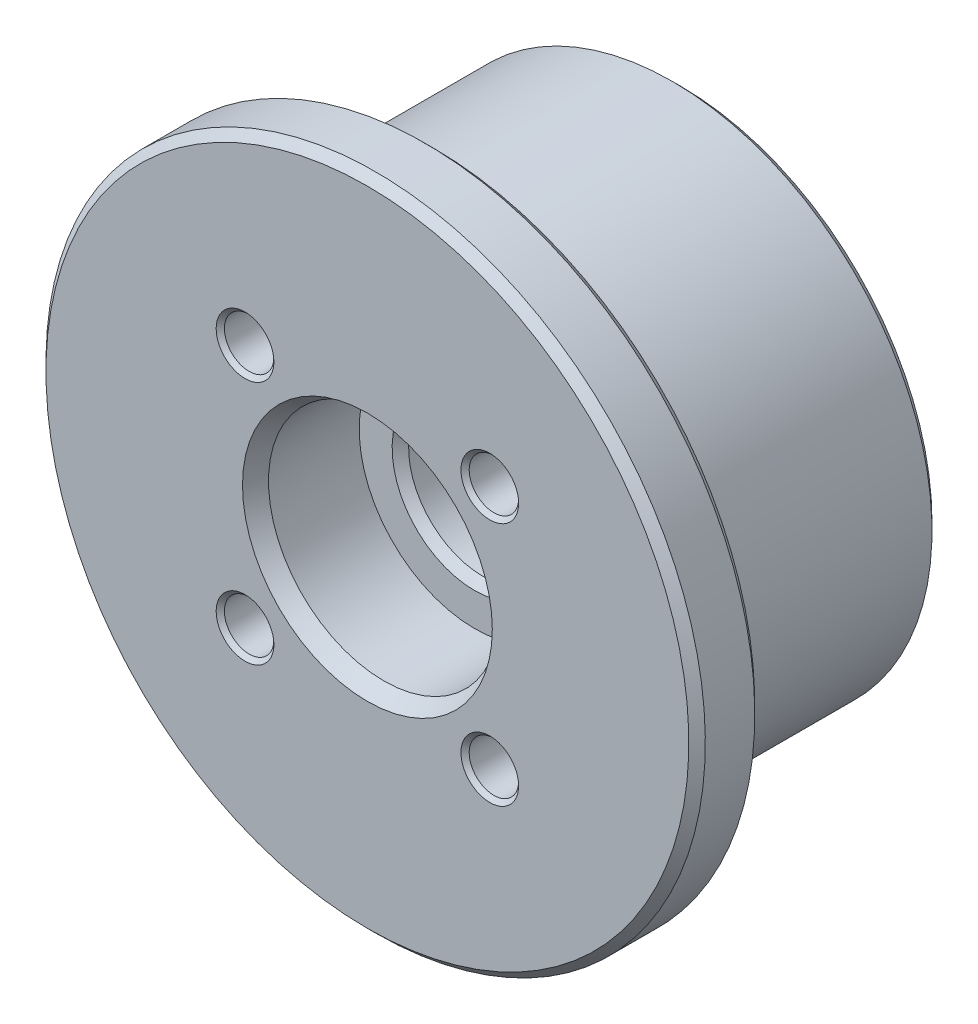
ISO-10303-21;
HEADER;
FILE_DESCRIPTION(('STEP AP214'),'2;1');
FILE_NAME('part.step','',(''),(''),'','','');
FILE_SCHEMA(('AUTOMOTIVE_DESIGN { 1 0 10303 214 1 1 1 1 }'));
ENDSEC;
DATA;
#1=APPLICATION_CONTEXT('core data for automotive mechanical design processes');
#2=APPLICATION_PROTOCOL_DEFINITION('international standard','automotive_design',2000,#1);
#3=PRODUCT_CONTEXT('',#1,'mechanical');
#4=PRODUCT('Part','Part','',(#3));
#5=PRODUCT_RELATED_PRODUCT_CATEGORY('part','',(#4));
#6=PRODUCT_DEFINITION_FORMATION('','',#4);
#7=PRODUCT_DEFINITION_CONTEXT('part definition',#1,'design');
#8=PRODUCT_DEFINITION('design','',#6,#7);
#9=PRODUCT_DEFINITION_SHAPE('','',#8);
#10=(LENGTH_UNIT() NAMED_UNIT(*) SI_UNIT(.MILLI.,.METRE.));
#11=(NAMED_UNIT(*) PLANE_ANGLE_UNIT() SI_UNIT($,.RADIAN.));
#12=(NAMED_UNIT(*) SI_UNIT($,.STERADIAN.) SOLID_ANGLE_UNIT());
#13=UNCERTAINTY_MEASURE_WITH_UNIT(LENGTH_MEASURE(1.E-05),#10,'distance_accuracy_value','');
#14=(GEOMETRIC_REPRESENTATION_CONTEXT(3) GLOBAL_UNCERTAINTY_ASSIGNED_CONTEXT((#13)) GLOBAL_UNIT_ASSIGNED_CONTEXT((#10,
#11,#12)) REPRESENTATION_CONTEXT('',''));
#15=CARTESIAN_POINT('',(0.,0.,0.));
#16=DIRECTION('',(0.,0.,1.));
#17=DIRECTION('',(1.,0.,0.));
#18=AXIS2_PLACEMENT_3D('',#15,#16,#17);
#19=CARTESIAN_POINT('',(40.,0.,30.));
#20=DIRECTION('',(0.,0.,1.));
#21=DIRECTION('',(0.,-1.,0.));
#22=AXIS2_PLACEMENT_3D('',#19,#20,#21);
#23=PLANE('',#22);
#24=CARTESIAN_POINT('',(0.,0.,30.));
#25=DIRECTION('',(0.,0.,1.));
#26=DIRECTION('',(0.,-1.,0.));
#27=AXIS2_PLACEMENT_3D('',#24,#25,#26);
#28=CIRCLE('',#27,39.);
#29=CARTESIAN_POINT('',(0.,-39.,30.));
#30=VERTEX_POINT('',#29);
#31=EDGE_CURVE('E99',#30,#30,#28,.F.);
#32=ORIENTED_EDGE('',*,*,#31,.T.);
#33=EDGE_LOOP('',(#32));
#34=FACE_BOUND('',#33,.T.);
#35=CARTESIAN_POINT('',(0.,0.,30.));
#36=DIRECTION('',(0.,0.,-1.));
#37=DIRECTION('',(0.,1.,0.));
#38=AXIS2_PLACEMENT_3D('',#35,#36,#37);
#39=CIRCLE('',#38,33.5);
#40=CARTESIAN_POINT('',(0.,33.5,30.));
#41=VERTEX_POINT('',#40);
#42=EDGE_CURVE('E63',#41,#41,#39,.T.);
#43=ORIENTED_EDGE('',*,*,#42,.F.);
#44=EDGE_LOOP('',(#43));
#45=FACE_BOUND('',#44,.T.);
#46=ADVANCED_FACE('F12',(#34,#45),#23,.F.);
#47=CARTESIAN_POINT('',(0.,0.,0.));
#48=DIRECTION('',(0.,0.,-1.));
#49=DIRECTION('',(0.,1.,0.));
#50=AXIS2_PLACEMENT_3D('',#47,#48,#49);
#51=CYLINDRICAL_SURFACE('',#50,31.5);
#52=CARTESIAN_POINT('',(0.,0.,1.00000000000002));
#53=DIRECTION('',(0.,0.,1.));
#54=DIRECTION('',(0.,-1.,0.));
#55=AXIS2_PLACEMENT_3D('',#52,#53,#54);
#56=CIRCLE('',#55,31.5);
#57=CARTESIAN_POINT('',(0.,-31.5,1.00000000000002));
#58=VERTEX_POINT('',#57);
#59=EDGE_CURVE('E96',#58,#58,#56,.T.);
#60=ORIENTED_EDGE('',*,*,#59,.T.);
#61=EDGE_LOOP('',(#60));
#62=FACE_BOUND('',#61,.T.);
#63=CARTESIAN_POINT('',(0.,0.,27.));
#64=DIRECTION('',(0.,0.,-1.));
#65=DIRECTION('',(0.,1.,0.));
#66=AXIS2_PLACEMENT_3D('',#63,#64,#65);
#67=CIRCLE('',#66,31.5);
#68=CARTESIAN_POINT('',(0.,31.5,27.));
#69=VERTEX_POINT('',#68);
#70=EDGE_CURVE('E32',#69,#69,#67,.T.);
#71=ORIENTED_EDGE('',*,*,#70,.T.);
#72=EDGE_LOOP('',(#71));
#73=FACE_BOUND('',#72,.T.);
#74=ADVANCED_FACE('F146',(#62,#73),#51,.T.);
#75=CARTESIAN_POINT('',(0.,0.,38.));
#76=DIRECTION('',(0.,0.,-1.));
#77=DIRECTION('',(0.,1.,0.));
#78=AXIS2_PLACEMENT_3D('',#75,#76,#77);
#79=CYLINDRICAL_SURFACE('',#78,40.);
#80=CARTESIAN_POINT('',(0.,0.,31.));
#81=DIRECTION('',(0.,0.,1.));
#82=DIRECTION('',(0.,-1.,0.));
#83=AXIS2_PLACEMENT_3D('',#80,#81,#82);
#84=CIRCLE('',#83,40.);
#85=CARTESIAN_POINT('',(0.,-40.,31.));
#86=VERTEX_POINT('',#85);
#87=EDGE_CURVE('E102',#86,#86,#84,.T.);
#88=ORIENTED_EDGE('',*,*,#87,.T.);
#89=EDGE_LOOP('',(#88));
#90=FACE_BOUND('',#89,.T.);
#91=CARTESIAN_POINT('',(0.,0.,37.));
#92=DIRECTION('',(0.,0.,1.));
#93=DIRECTION('',(0.,-1.,0.));
#94=AXIS2_PLACEMENT_3D('',#91,#92,#93);
#95=CIRCLE('',#94,40.);
#96=CARTESIAN_POINT('',(0.,-40.,37.));
#97=VERTEX_POINT('',#96);
#98=EDGE_CURVE('E81',#97,#97,#95,.F.);
#99=ORIENTED_EDGE('',*,*,#98,.T.);
#100=EDGE_LOOP('',(#99));
#101=FACE_BOUND('',#100,.T.);
#102=ADVANCED_FACE('F153',(#90,#101),#79,.T.);
#103=CARTESIAN_POINT('',(0.,0.,38.));
#104=DIRECTION('',(0.,0.,1.));
#105=DIRECTION('',(0.,-1.,0.));
#106=AXIS2_PLACEMENT_3D('',#103,#104,#105);
#107=PLANE('',#106);
#108=CARTESIAN_POINT('',(0.,0.,38.));
#109=DIRECTION('',(0.,0.,1.));
#110=DIRECTION('',(0.,-1.,0.));
#111=AXIS2_PLACEMENT_3D('',#108,#109,#110);
#112=CIRCLE('',#111,15.1547005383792);
#113=CARTESIAN_POINT('',(0.,-15.1547005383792,38.));
#114=VERTEX_POINT('',#113);
#115=EDGE_CURVE('E90',#114,#114,#112,.F.);
#116=ORIENTED_EDGE('',*,*,#115,.T.);
#117=EDGE_LOOP('',(#116));
#118=FACE_BOUND('',#117,.T.);
#119=CARTESIAN_POINT('',(0.,0.,38.));
#120=DIRECTION('',(0.,0.,1.));
#121=DIRECTION('',(0.,-1.,0.));
#122=AXIS2_PLACEMENT_3D('',#119,#120,#121);
#123=CIRCLE('',#122,39.);
#124=CARTESIAN_POINT('',(0.,-39.,38.));
#125=VERTEX_POINT('',#124);
#126=EDGE_CURVE('E84',#125,#125,#123,.T.);
#127=ORIENTED_EDGE('',*,*,#126,.T.);
#128=EDGE_LOOP('',(#127));
#129=FACE_BOUND('',#128,.T.);
#130=CARTESIAN_POINT('',(-14.8492424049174,14.8492424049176,38.));
#131=DIRECTION('',(0.,0.,1.));
#132=DIRECTION('',(0.,-1.,0.));
#133=AXIS2_PLACEMENT_3D('',#130,#131,#132);
#134=CIRCLE('',#133,3.5);
#135=CARTESIAN_POINT('',(-14.8492424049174,11.3492424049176,38.));
#136=VERTEX_POINT('',#135);
#137=EDGE_CURVE('E66',#136,#136,#134,.T.);
#138=ORIENTED_EDGE('',*,*,#137,.F.);
#139=EDGE_LOOP('',(#138));
#140=FACE_BOUND('',#139,.T.);
#141=CARTESIAN_POINT('',(-14.8492424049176,-14.8492424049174,38.));
#142=DIRECTION('',(0.,0.,1.));
#143=DIRECTION('',(0.,-1.,0.));
#144=AXIS2_PLACEMENT_3D('',#141,#142,#143);
#145=CIRCLE('',#144,3.5);
#146=CARTESIAN_POINT('',(-14.8492424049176,-18.3492424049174,38.));
#147=VERTEX_POINT('',#146);
#148=EDGE_CURVE('E69',#147,#147,#145,.T.);
#149=ORIENTED_EDGE('',*,*,#148,.F.);
#150=EDGE_LOOP('',(#149));
#151=FACE_BOUND('',#150,.T.);
#152=CARTESIAN_POINT('',(14.8492424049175,-14.8492424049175,38.));
#153=DIRECTION('',(0.,0.,1.));
#154=DIRECTION('',(0.,-1.,0.));
#155=AXIS2_PLACEMENT_3D('',#152,#153,#154);
#156=CIRCLE('',#155,3.5);
#157=CARTESIAN_POINT('',(14.8492424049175,-18.3492424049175,38.));
#158=VERTEX_POINT('',#157);
#159=EDGE_CURVE('E72',#158,#158,#156,.T.);
#160=ORIENTED_EDGE('',*,*,#159,.F.);
#161=EDGE_LOOP('',(#160));
#162=FACE_BOUND('',#161,.T.);
#163=CARTESIAN_POINT('',(14.8492424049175,14.8492424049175,38.));
#164=DIRECTION('',(0.,0.,1.));
#165=DIRECTION('',(0.,-1.,0.));
#166=AXIS2_PLACEMENT_3D('',#163,#164,#165);
#167=CIRCLE('',#166,3.5);
#168=CARTESIAN_POINT('',(14.8492424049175,11.3492424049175,38.));
#169=VERTEX_POINT('',#168);
#170=EDGE_CURVE('E75',#169,#169,#167,.T.);
#171=ORIENTED_EDGE('',*,*,#170,.F.);
#172=EDGE_LOOP('',(#171));
#173=FACE_BOUND('',#172,.T.);
#174=ADVANCED_FACE('F122',(#118,#129,#140,#151,#162,#173),#107,.T.);
#175=CARTESIAN_POINT('',(0.,0.,0.));
#176=DIRECTION('',(0.,0.,1.));
#177=DIRECTION('',(0.,-1.,0.));
#178=AXIS2_PLACEMENT_3D('',#175,#176,#177);
#179=PLANE('',#178);
#180=CARTESIAN_POINT('',(0.,0.,0.));
#181=DIRECTION('',(0.,0.,1.));
#182=DIRECTION('',(0.,-1.,0.));
#183=AXIS2_PLACEMENT_3D('',#180,#181,#182);
#184=CIRCLE('',#183,10.1547005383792);
#185=CARTESIAN_POINT('',(0.,-10.1547005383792,0.));
#186=VERTEX_POINT('',#185);
#187=EDGE_CURVE('E105',#186,#186,#184,.T.);
#188=ORIENTED_EDGE('',*,*,#187,.T.);
#189=EDGE_LOOP('',(#188));
#190=FACE_BOUND('',#189,.T.);
#191=CARTESIAN_POINT('',(0.,0.,0.));
#192=DIRECTION('',(0.,0.,1.));
#193=DIRECTION('',(0.,-1.,0.));
#194=AXIS2_PLACEMENT_3D('',#191,#192,#193);
#195=CIRCLE('',#194,30.5);
#196=CARTESIAN_POINT('',(0.,-30.5,0.));
#197=VERTEX_POINT('',#196);
#198=EDGE_CURVE('E93',#197,#197,#195,.F.);
#199=ORIENTED_EDGE('',*,*,#198,.T.);
#200=EDGE_LOOP('',(#199));
#201=FACE_BOUND('',#200,.T.);
#202=ADVANCED_FACE('F118',(#190,#201),#179,.F.);
#203=CARTESIAN_POINT('',(0.,0.,25.));
#204=DIRECTION('',(0.,0.,1.));
#205=DIRECTION('',(0.,-1.,0.));
#206=AXIS2_PLACEMENT_3D('',#203,#204,#205);
#207=CYLINDRICAL_SURFACE('',#206,14.);
#208=CARTESIAN_POINT('',(0.,0.,36.));
#209=DIRECTION('',(0.,0.,1.));
#210=DIRECTION('',(0.,-1.,0.));
#211=AXIS2_PLACEMENT_3D('',#208,#209,#210);
#212=CIRCLE('',#211,14.);
#213=CARTESIAN_POINT('',(0.,-14.,36.));
#214=VERTEX_POINT('',#213);
#215=EDGE_CURVE('E87',#214,#214,#212,.T.);
#216=ORIENTED_EDGE('',*,*,#215,.T.);
#217=EDGE_LOOP('',(#216));
#218=FACE_BOUND('',#217,.T.);
#219=CARTESIAN_POINT('',(0.,0.,25.));
#220=DIRECTION('',(0.,0.,1.));
#221=DIRECTION('',(0.,-1.,0.));
#222=AXIS2_PLACEMENT_3D('',#219,#220,#221);
#223=CIRCLE('',#222,14.);
#224=CARTESIAN_POINT('',(0.,-14.,25.));
#225=VERTEX_POINT('',#224);
#226=EDGE_CURVE('E78',#225,#225,#223,.T.);
#227=ORIENTED_EDGE('',*,*,#226,.F.);
#228=EDGE_LOOP('',(#227));
#229=FACE_BOUND('',#228,.T.);
#230=ADVANCED_FACE('F121',(#218,#229),#207,.F.);
#231=CARTESIAN_POINT('',(0.,0.,25.));
#232=DIRECTION('',(0.,0.,1.));
#233=DIRECTION('',(0.,-1.,0.));
#234=AXIS2_PLACEMENT_3D('',#231,#232,#233);
#235=PLANE('',#234);
#236=CARTESIAN_POINT('',(0.,0.,25.));
#237=DIRECTION('',(0.,0.,1.));
#238=DIRECTION('',(0.,-1.,0.));
#239=AXIS2_PLACEMENT_3D('',#236,#237,#238);
#240=CIRCLE('',#239,10.);
#241=CARTESIAN_POINT('',(0.,-10.,25.));
#242=VERTEX_POINT('',#241);
#243=EDGE_CURVE('E8',#242,#242,#240,.F.);
#244=ORIENTED_EDGE('',*,*,#243,.T.);
#245=EDGE_LOOP('',(#244));
#246=FACE_BOUND('',#245,.T.);
#247=ORIENTED_EDGE('',*,*,#226,.T.);
#248=EDGE_LOOP('',(#247));
#249=FACE_BOUND('',#248,.T.);
#250=ADVANCED_FACE('F176',(#246,#249),#235,.T.);
#251=CARTESIAN_POINT('',(0.,0.,38.));
#252=DIRECTION('',(0.,0.,1.));
#253=DIRECTION('',(0.,-1.,0.));
#254=AXIS2_PLACEMENT_3D('',#251,#252,#253);
#255=CYLINDRICAL_SURFACE('',#254,9.);
#256=CARTESIAN_POINT('',(0.,0.,24.));
#257=DIRECTION('',(0.,0.,1.));
#258=DIRECTION('',(0.,-1.,0.));
#259=AXIS2_PLACEMENT_3D('',#256,#257,#258);
#260=CIRCLE('',#259,9.);
#261=CARTESIAN_POINT('',(0.,-9.,24.));
#262=VERTEX_POINT('',#261);
#263=EDGE_CURVE('E20',#262,#262,#260,.T.);
#264=ORIENTED_EDGE('',*,*,#263,.T.);
#265=EDGE_LOOP('',(#264));
#266=FACE_BOUND('',#265,.T.);
#267=CARTESIAN_POINT('',(0.,0.,2.));
#268=DIRECTION('',(0.,0.,1.));
#269=DIRECTION('',(0.,-1.,0.));
#270=AXIS2_PLACEMENT_3D('',#267,#268,#269);
#271=CIRCLE('',#270,9.);
#272=CARTESIAN_POINT('',(0.,-9.,2.));
#273=VERTEX_POINT('',#272);
#274=EDGE_CURVE('E25',#273,#273,#271,.F.);
#275=ORIENTED_EDGE('',*,*,#274,.T.);
#276=EDGE_LOOP('',(#275));
#277=FACE_BOUND('',#276,.T.);
#278=ADVANCED_FACE('F110',(#266,#277),#255,.F.);
#279=CARTESIAN_POINT('',(14.8492424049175,14.8492424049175,38.));
#280=DIRECTION('',(0.,0.,1.));
#281=DIRECTION('',(0.,-1.,0.));
#282=AXIS2_PLACEMENT_3D('',#279,#280,#281);
#283=CONICAL_SURFACE('',#282,3.5,0.785398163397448);
#284=CARTESIAN_POINT('',(14.8492424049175,14.8492424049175,37.5));
#285=DIRECTION('',(0.,0.,1.));
#286=DIRECTION('',(1.,0.,0.));
#287=AXIS2_PLACEMENT_3D('',#284,#285,#286);
#288=CIRCLE('',#287,3.);
#289=CARTESIAN_POINT('',(17.8492424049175,14.8492424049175,37.5));
#290=VERTEX_POINT('',#289);
#291=EDGE_CURVE('E35',#290,#290,#288,.F.);
#292=ORIENTED_EDGE('',*,*,#291,.T.);
#293=EDGE_LOOP('',(#292));
#294=FACE_BOUND('',#293,.T.);
#295=ORIENTED_EDGE('',*,*,#170,.T.);
#296=EDGE_LOOP('',(#295));
#297=FACE_BOUND('',#296,.T.);
#298=ADVANCED_FACE('F170',(#294,#297),#283,.F.);
#299=CARTESIAN_POINT('',(14.8492424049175,-14.8492424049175,38.));
#300=DIRECTION('',(0.,0.,1.));
#301=DIRECTION('',(0.,-1.,0.));
#302=AXIS2_PLACEMENT_3D('',#299,#300,#301);
#303=CONICAL_SURFACE('',#302,3.5,0.78539816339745);
#304=CARTESIAN_POINT('',(14.8492424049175,-14.8492424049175,37.5));
#305=DIRECTION('',(0.,0.,1.));
#306=DIRECTION('',(1.,0.,0.));
#307=AXIS2_PLACEMENT_3D('',#304,#305,#306);
#308=CIRCLE('',#307,3.);
#309=CARTESIAN_POINT('',(17.8492424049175,-14.8492424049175,37.5));
#310=VERTEX_POINT('',#309);
#311=EDGE_CURVE('E16',#310,#310,#308,.F.);
#312=ORIENTED_EDGE('',*,*,#311,.T.);
#313=EDGE_LOOP('',(#312));
#314=FACE_BOUND('',#313,.T.);
#315=ORIENTED_EDGE('',*,*,#159,.T.);
#316=EDGE_LOOP('',(#315));
#317=FACE_BOUND('',#316,.T.);
#318=ADVANCED_FACE('F166',(#314,#317),#303,.F.);
#319=CARTESIAN_POINT('',(-14.8492424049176,-14.8492424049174,38.));
#320=DIRECTION('',(0.,0.,1.));
#321=DIRECTION('',(0.,-1.,0.));
#322=AXIS2_PLACEMENT_3D('',#319,#320,#321);
#323=CONICAL_SURFACE('',#322,3.5,0.785398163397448);
#324=CARTESIAN_POINT('',(-14.8492424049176,-14.8492424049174,37.5));
#325=DIRECTION('',(0.,0.,1.));
#326=DIRECTION('',(1.,0.,0.));
#327=AXIS2_PLACEMENT_3D('',#324,#325,#326);
#328=CIRCLE('',#327,3.);
#329=CARTESIAN_POINT('',(-11.8492424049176,-14.8492424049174,37.5));
#330=VERTEX_POINT('',#329);
#331=EDGE_CURVE('E29',#330,#330,#328,.F.);
#332=ORIENTED_EDGE('',*,*,#331,.T.);
#333=EDGE_LOOP('',(#332));
#334=FACE_BOUND('',#333,.T.);
#335=ORIENTED_EDGE('',*,*,#148,.T.);
#336=EDGE_LOOP('',(#335));
#337=FACE_BOUND('',#336,.T.);
#338=ADVANCED_FACE('F162',(#334,#337),#323,.F.);
#339=CARTESIAN_POINT('',(-14.8492424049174,14.8492424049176,38.));
#340=DIRECTION('',(0.,0.,1.));
#341=DIRECTION('',(0.,-1.,0.));
#342=AXIS2_PLACEMENT_3D('',#339,#340,#341);
#343=CONICAL_SURFACE('',#342,3.5,0.785398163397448);
#344=CARTESIAN_POINT('',(-14.8492424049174,14.8492424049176,37.5));
#345=DIRECTION('',(0.,0.,1.));
#346=DIRECTION('',(1.,0.,0.));
#347=AXIS2_PLACEMENT_3D('',#344,#345,#346);
#348=CIRCLE('',#347,3.);
#349=CARTESIAN_POINT('',(-11.8492424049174,14.8492424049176,37.5));
#350=VERTEX_POINT('',#349);
#351=EDGE_CURVE('E33',#350,#350,#348,.F.);
#352=ORIENTED_EDGE('',*,*,#351,.T.);
#353=EDGE_LOOP('',(#352));
#354=FACE_BOUND('',#353,.T.);
#355=ORIENTED_EDGE('',*,*,#137,.T.);
#356=EDGE_LOOP('',(#355));
#357=FACE_BOUND('',#356,.T.);
#358=ADVANCED_FACE('F159',(#354,#357),#343,.F.);
#359=CARTESIAN_POINT('',(0.,0.,38.));
#360=DIRECTION('',(0.,0.,-1.));
#361=DIRECTION('',(0.,1.,0.));
#362=AXIS2_PLACEMENT_3D('',#359,#360,#361);
#363=CONICAL_SURFACE('',#362,39.,0.785398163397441);
#364=ORIENTED_EDGE('',*,*,#98,.F.);
#365=EDGE_LOOP('',(#364));
#366=FACE_BOUND('',#365,.T.);
#367=ORIENTED_EDGE('',*,*,#126,.F.);
#368=EDGE_LOOP('',(#367));
#369=FACE_BOUND('',#368,.T.);
#370=ADVANCED_FACE('F141',(#366,#369),#363,.T.);
#371=CARTESIAN_POINT('',(0.,0.,36.));
#372=DIRECTION('',(0.,0.,1.));
#373=DIRECTION('',(0.,-1.,0.));
#374=AXIS2_PLACEMENT_3D('',#371,#372,#373);
#375=CONICAL_SURFACE('',#374,14.,0.523598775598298);
#376=ORIENTED_EDGE('',*,*,#115,.F.);
#377=EDGE_LOOP('',(#376));
#378=FACE_BOUND('',#377,.T.);
#379=ORIENTED_EDGE('',*,*,#215,.F.);
#380=EDGE_LOOP('',(#379));
#381=FACE_BOUND('',#380,.T.);
#382=ADVANCED_FACE('F129',(#378,#381),#375,.F.);
#383=CARTESIAN_POINT('',(0.,0.,0.));
#384=DIRECTION('',(0.,0.,1.));
#385=DIRECTION('',(0.,-1.,0.));
#386=AXIS2_PLACEMENT_3D('',#383,#384,#385);
#387=CONICAL_SURFACE('',#386,30.5,0.785398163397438);
#388=ORIENTED_EDGE('',*,*,#59,.F.);
#389=EDGE_LOOP('',(#388));
#390=FACE_BOUND('',#389,.T.);
#391=ORIENTED_EDGE('',*,*,#198,.F.);
#392=EDGE_LOOP('',(#391));
#393=FACE_BOUND('',#392,.T.);
#394=ADVANCED_FACE('F126',(#390,#393),#387,.T.);
#395=CARTESIAN_POINT('',(0.,0.,30.));
#396=DIRECTION('',(0.,0.,1.));
#397=DIRECTION('',(0.,-1.,0.));
#398=AXIS2_PLACEMENT_3D('',#395,#396,#397);
#399=CONICAL_SURFACE('',#398,39.,0.785398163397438);
#400=ORIENTED_EDGE('',*,*,#87,.F.);
#401=EDGE_LOOP('',(#400));
#402=FACE_BOUND('',#401,.T.);
#403=ORIENTED_EDGE('',*,*,#31,.F.);
#404=EDGE_LOOP('',(#403));
#405=FACE_BOUND('',#404,.T.);
#406=ADVANCED_FACE('F128',(#402,#405),#399,.T.);
#407=CARTESIAN_POINT('',(0.,0.,30.5));
#408=DIRECTION('',(0.,0.,-1.));
#409=DIRECTION('',(0.,1.,0.));
#410=AXIS2_PLACEMENT_3D('',#407,#408,#409);
#411=CONICAL_SURFACE('',#410,33.,0.785398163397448);
#412=ORIENTED_EDGE('',*,*,#42,.T.);
#413=EDGE_LOOP('',(#412));
#414=FACE_BOUND('',#413,.T.);
#415=CARTESIAN_POINT('',(0.,0.,30.5));
#416=DIRECTION('',(0.,0.,-1.));
#417=DIRECTION('',(0.,1.,0.));
#418=AXIS2_PLACEMENT_3D('',#415,#416,#417);
#419=CIRCLE('',#418,33.);
#420=CARTESIAN_POINT('',(0.,33.,30.5));
#421=VERTEX_POINT('',#420);
#422=EDGE_CURVE('E60',#421,#421,#419,.T.);
#423=ORIENTED_EDGE('',*,*,#422,.F.);
#424=EDGE_LOOP('',(#423));
#425=FACE_BOUND('',#424,.T.);
#426=ADVANCED_FACE('F138',(#414,#425),#411,.F.);
#427=CARTESIAN_POINT('',(-33.,0.,30.5));
#428=DIRECTION('',(0.,0.,-1.));
#429=DIRECTION('',(0.,1.,0.));
#430=AXIS2_PLACEMENT_3D('',#427,#428,#429);
#431=PLANE('',#430);
#432=ORIENTED_EDGE('',*,*,#422,.T.);
#433=EDGE_LOOP('',(#432));
#434=FACE_BOUND('',#433,.T.);
#435=CARTESIAN_POINT('',(0.,0.,30.5));
#436=DIRECTION('',(0.,0.,-1.));
#437=DIRECTION('',(0.,1.,0.));
#438=AXIS2_PLACEMENT_3D('',#435,#436,#437);
#439=CIRCLE('',#438,31.4);
#440=CARTESIAN_POINT('',(0.,31.4,30.5));
#441=VERTEX_POINT('',#440);
#442=EDGE_CURVE('E57',#441,#441,#439,.T.);
#443=ORIENTED_EDGE('',*,*,#442,.F.);
#444=EDGE_LOOP('',(#443));
#445=FACE_BOUND('',#444,.T.);
#446=ADVANCED_FACE('F310',(#434,#445),#431,.T.);
#447=CARTESIAN_POINT('',(0.,0.,30.1));
#448=DIRECTION('',(0.,0.,-1.));
#449=DIRECTION('',(0.,1.,0.));
#450=AXIS2_PLACEMENT_3D('',#447,#448,#449);
#451=TOROIDAL_SURFACE('',#450,31.4,0.4);
#452=ORIENTED_EDGE('',*,*,#442,.T.);
#453=EDGE_LOOP('',(#452));
#454=FACE_BOUND('',#453,.T.);
#455=CARTESIAN_POINT('',(0.,0.,30.1));
#456=DIRECTION('',(0.,0.,-1.));
#457=DIRECTION('',(0.,1.,0.));
#458=AXIS2_PLACEMENT_3D('',#455,#456,#457);
#459=CIRCLE('',#458,31.);
#460=CARTESIAN_POINT('',(0.,31.,30.1));
#461=VERTEX_POINT('',#460);
#462=EDGE_CURVE('E54',#461,#461,#459,.T.);
#463=ORIENTED_EDGE('',*,*,#462,.F.);
#464=EDGE_LOOP('',(#463));
#465=FACE_BOUND('',#464,.T.);
#466=ADVANCED_FACE('F317',(#454,#465),#451,.F.);
#467=CARTESIAN_POINT('',(0.,0.,0.));
#468=DIRECTION('',(0.,0.,-1.));
#469=DIRECTION('',(0.,1.,0.));
#470=AXIS2_PLACEMENT_3D('',#467,#468,#469);
#471=CYLINDRICAL_SURFACE('',#470,31.);
#472=ORIENTED_EDGE('',*,*,#462,.T.);
#473=EDGE_LOOP('',(#472));
#474=FACE_BOUND('',#473,.T.);
#475=CARTESIAN_POINT('',(0.,0.,27.5));
#476=DIRECTION('',(0.,0.,-1.));
#477=DIRECTION('',(0.,1.,0.));
#478=AXIS2_PLACEMENT_3D('',#475,#476,#477);
#479=CIRCLE('',#478,31.);
#480=CARTESIAN_POINT('',(0.,31.,27.5));
#481=VERTEX_POINT('',#480);
#482=EDGE_CURVE('E51',#481,#481,#479,.T.);
#483=ORIENTED_EDGE('',*,*,#482,.F.);
#484=EDGE_LOOP('',(#483));
#485=FACE_BOUND('',#484,.T.);
#486=ADVANCED_FACE('F325',(#474,#485),#471,.T.);
#487=CARTESIAN_POINT('',(0.,0.,27.));
#488=DIRECTION('',(0.,0.,-1.));
#489=DIRECTION('',(0.,1.,0.));
#490=AXIS2_PLACEMENT_3D('',#487,#488,#489);
#491=CONICAL_SURFACE('',#490,31.5,0.785398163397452);
#492=ORIENTED_EDGE('',*,*,#482,.T.);
#493=EDGE_LOOP('',(#492));
#494=FACE_BOUND('',#493,.T.);
#495=ORIENTED_EDGE('',*,*,#70,.F.);
#496=EDGE_LOOP('',(#495));
#497=FACE_BOUND('',#496,.T.);
#498=ADVANCED_FACE('F115',(#494,#497),#491,.T.);
#499=CARTESIAN_POINT('',(0.,0.,0.));
#500=DIRECTION('',(0.,0.,-1.));
#501=DIRECTION('',(0.,1.,0.));
#502=AXIS2_PLACEMENT_3D('',#499,#500,#501);
#503=CONICAL_SURFACE('',#502,10.1547005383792,0.523598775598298);
#504=ORIENTED_EDGE('',*,*,#274,.F.);
#505=EDGE_LOOP('',(#504));
#506=FACE_BOUND('',#505,.T.);
#507=ORIENTED_EDGE('',*,*,#187,.F.);
#508=EDGE_LOOP('',(#507));
#509=FACE_BOUND('',#508,.T.);
#510=ADVANCED_FACE('F112',(#506,#509),#503,.F.);
#511=CARTESIAN_POINT('',(0.,0.,24.));
#512=DIRECTION('',(0.,0.,1.));
#513=DIRECTION('',(0.,-1.,0.));
#514=AXIS2_PLACEMENT_3D('',#511,#512,#513);
#515=CONICAL_SURFACE('',#514,9.,0.785398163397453);
#516=ORIENTED_EDGE('',*,*,#243,.F.);
#517=EDGE_LOOP('',(#516));
#518=FACE_BOUND('',#517,.T.);
#519=ORIENTED_EDGE('',*,*,#263,.F.);
#520=EDGE_LOOP('',(#519));
#521=FACE_BOUND('',#520,.T.);
#522=ADVANCED_FACE('F14',(#518,#521),#515,.F.);
#523=CARTESIAN_POINT('',(-14.8492424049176,-14.8492424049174,26.));
#524=DIRECTION('',(0.,0.,1.));
#525=DIRECTION('',(1.,0.,0.));
#526=AXIS2_PLACEMENT_3D('',#523,#524,#525);
#527=CYLINDRICAL_SURFACE('',#526,3.);
#528=CARTESIAN_POINT('',(-14.8492424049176,-14.8492424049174,26.));
#529=DIRECTION('',(0.,0.,1.));
#530=DIRECTION('',(1.,0.,0.));
#531=AXIS2_PLACEMENT_3D('',#528,#529,#530);
#532=CIRCLE('',#531,3.);
#533=CARTESIAN_POINT('',(-11.8492424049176,-14.8492424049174,26.));
#534=VERTEX_POINT('',#533);
#535=EDGE_CURVE('E447',#534,#534,#532,.T.);
#536=ORIENTED_EDGE('',*,*,#535,.F.);
#537=EDGE_LOOP('',(#536));
#538=FACE_BOUND('',#537,.T.);
#539=ORIENTED_EDGE('',*,*,#331,.F.);
#540=EDGE_LOOP('',(#539));
#541=FACE_BOUND('',#540,.T.);
#542=ADVANCED_FACE('F348',(#538,#541),#527,.F.);
#543=CARTESIAN_POINT('',(-14.8492424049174,14.8492424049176,26.));
#544=DIRECTION('',(0.,0.,1.));
#545=DIRECTION('',(1.,0.,0.));
#546=AXIS2_PLACEMENT_3D('',#543,#544,#545);
#547=CYLINDRICAL_SURFACE('',#546,3.);
#548=CARTESIAN_POINT('',(-14.8492424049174,14.8492424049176,26.));
#549=DIRECTION('',(0.,0.,1.));
#550=DIRECTION('',(1.,0.,0.));
#551=AXIS2_PLACEMENT_3D('',#548,#549,#550);
#552=CIRCLE('',#551,3.);
#553=CARTESIAN_POINT('',(-11.8492424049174,14.8492424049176,26.));
#554=VERTEX_POINT('',#553);
#555=EDGE_CURVE('E446',#554,#554,#552,.T.);
#556=ORIENTED_EDGE('',*,*,#555,.F.);
#557=EDGE_LOOP('',(#556));
#558=FACE_BOUND('',#557,.T.);
#559=ORIENTED_EDGE('',*,*,#351,.F.);
#560=EDGE_LOOP('',(#559));
#561=FACE_BOUND('',#560,.T.);
#562=ADVANCED_FACE('F355',(#558,#561),#547,.F.);
#563=CARTESIAN_POINT('',(14.8492424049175,14.8492424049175,26.));
#564=DIRECTION('',(0.,0.,1.));
#565=DIRECTION('',(1.,0.,0.));
#566=AXIS2_PLACEMENT_3D('',#563,#564,#565);
#567=PLANE('',#566);
#568=CARTESIAN_POINT('',(14.8492424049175,14.8492424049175,26.));
#569=DIRECTION('',(0.,0.,1.));
#570=DIRECTION('',(1.,0.,0.));
#571=AXIS2_PLACEMENT_3D('',#568,#569,#570);
#572=CIRCLE('',#571,3.);
#573=CARTESIAN_POINT('',(17.8492424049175,14.8492424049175,26.));
#574=VERTEX_POINT('',#573);
#575=EDGE_CURVE('E37',#574,#574,#572,.T.);
#576=ORIENTED_EDGE('',*,*,#575,.T.);
#577=EDGE_LOOP('',(#576));
#578=FACE_BOUND('',#577,.T.);
#579=ADVANCED_FACE('F363',(#578),#567,.T.);
#580=CARTESIAN_POINT('',(14.8492424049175,14.8492424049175,26.));
#581=DIRECTION('',(0.,0.,1.));
#582=DIRECTION('',(1.,0.,0.));
#583=AXIS2_PLACEMENT_3D('',#580,#581,#582);
#584=CYLINDRICAL_SURFACE('',#583,3.);
#585=ORIENTED_EDGE('',*,*,#575,.F.);
#586=EDGE_LOOP('',(#585));
#587=FACE_BOUND('',#586,.T.);
#588=ORIENTED_EDGE('',*,*,#291,.F.);
#589=EDGE_LOOP('',(#588));
#590=FACE_BOUND('',#589,.T.);
#591=ADVANCED_FACE('F371',(#587,#590),#584,.F.);
#592=CARTESIAN_POINT('',(14.8492424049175,-14.8492424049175,26.));
#593=DIRECTION('',(0.,0.,1.));
#594=DIRECTION('',(1.,0.,0.));
#595=AXIS2_PLACEMENT_3D('',#592,#593,#594);
#596=PLANE('',#595);
#597=CARTESIAN_POINT('',(14.8492424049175,-14.8492424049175,26.));
#598=DIRECTION('',(0.,0.,1.));
#599=DIRECTION('',(1.,0.,0.));
#600=AXIS2_PLACEMENT_3D('',#597,#598,#599);
#601=CIRCLE('',#600,3.);
#602=CARTESIAN_POINT('',(17.8492424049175,-14.8492424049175,26.));
#603=VERTEX_POINT('',#602);
#604=EDGE_CURVE('E45',#603,#603,#601,.T.);
#605=ORIENTED_EDGE('',*,*,#604,.T.);
#606=EDGE_LOOP('',(#605));
#607=FACE_BOUND('',#606,.T.);
#608=ADVANCED_FACE('F378',(#607),#596,.T.);
#609=CARTESIAN_POINT('',(14.8492424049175,-14.8492424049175,26.));
#610=DIRECTION('',(0.,0.,1.));
#611=DIRECTION('',(1.,0.,0.));
#612=AXIS2_PLACEMENT_3D('',#609,#610,#611);
#613=CYLINDRICAL_SURFACE('',#612,3.);
#614=ORIENTED_EDGE('',*,*,#604,.F.);
#615=EDGE_LOOP('',(#614));
#616=FACE_BOUND('',#615,.T.);
#617=ORIENTED_EDGE('',*,*,#311,.F.);
#618=EDGE_LOOP('',(#617));
#619=FACE_BOUND('',#618,.T.);
#620=ADVANCED_FACE('F386',(#616,#619),#613,.F.);
#621=CARTESIAN_POINT('',(-14.8492424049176,-14.8492424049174,26.));
#622=DIRECTION('',(0.,0.,1.));
#623=DIRECTION('',(1.,0.,0.));
#624=AXIS2_PLACEMENT_3D('',#621,#622,#623);
#625=PLANE('',#624);
#626=ORIENTED_EDGE('',*,*,#535,.T.);
#627=EDGE_LOOP('',(#626));
#628=FACE_BOUND('',#627,.T.);
#629=ADVANCED_FACE('F394',(#628),#625,.T.);
#630=CARTESIAN_POINT('',(-14.8492424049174,14.8492424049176,26.));
#631=DIRECTION('',(0.,0.,1.));
#632=DIRECTION('',(1.,0.,0.));
#633=AXIS2_PLACEMENT_3D('',#630,#631,#632);
#634=PLANE('',#633);
#635=ORIENTED_EDGE('',*,*,#555,.T.);
#636=EDGE_LOOP('',(#635));
#637=FACE_BOUND('',#636,.T.);
#638=ADVANCED_FACE('F402',(#637),#634,.T.);
#639=CLOSED_SHELL('',(#46,#74,#102,#174,#202,#230,#250,#278,#298,#318,#338,#358,#370,#382,#394,
#406,#426,#446,#466,#486,#498,#510,#522,#542,#562,#579,#591,#608,#620,#629,#638));
#640=MANIFOLD_SOLID_BREP('B1',#639);
#641=ADVANCED_BREP_SHAPE_REPRESENTATION('',(#18,#640),#14);
#642=SHAPE_DEFINITION_REPRESENTATION(#9,#641);
ENDSEC;
END-ISO-10303-21;
